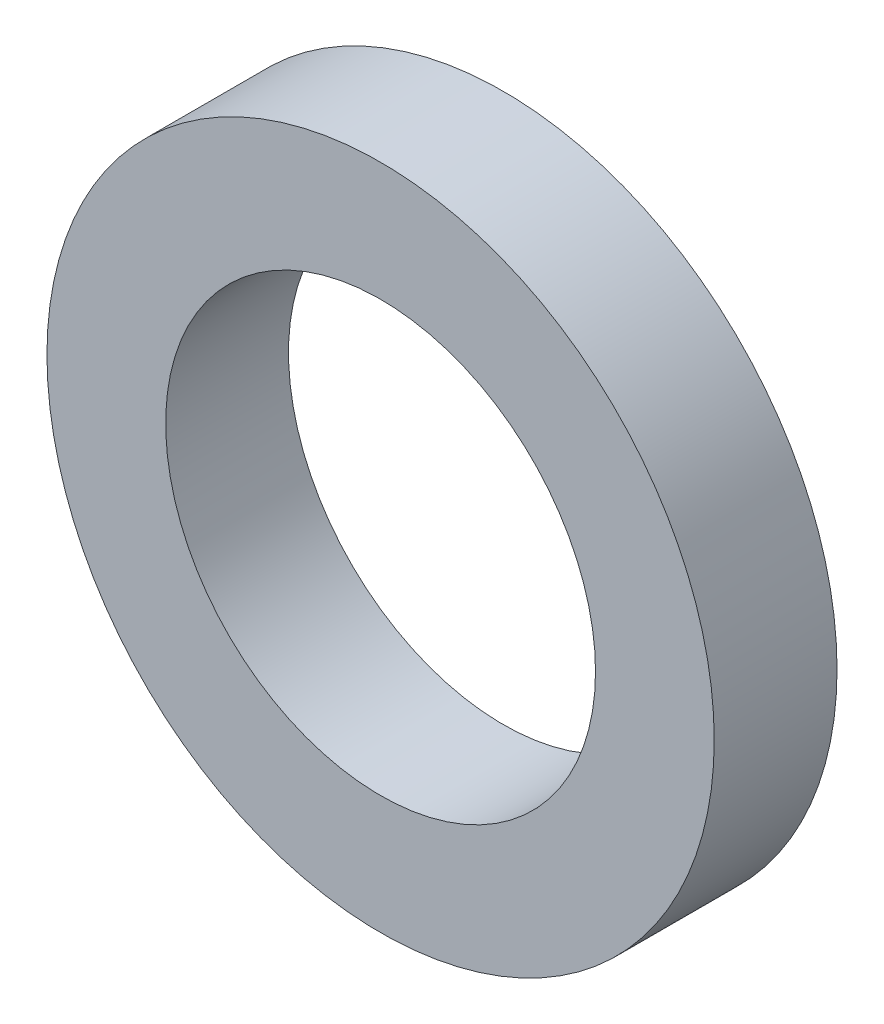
ISO-10303-21;
HEADER;
FILE_DESCRIPTION(('STEP AP214'),'2;1');
FILE_NAME('part.step','',(''),(''),'','','');
FILE_SCHEMA(('AUTOMOTIVE_DESIGN { 1 0 10303 214 1 1 1 1 }'));
ENDSEC;
DATA;
#1=APPLICATION_CONTEXT('core data for automotive mechanical design processes');
#2=APPLICATION_PROTOCOL_DEFINITION('international standard','automotive_design',2000,#1);
#3=PRODUCT_CONTEXT('',#1,'mechanical');
#4=PRODUCT('Part','Part','',(#3));
#5=PRODUCT_RELATED_PRODUCT_CATEGORY('part','',(#4));
#6=PRODUCT_DEFINITION_FORMATION('','',#4);
#7=PRODUCT_DEFINITION_CONTEXT('part definition',#1,'design');
#8=PRODUCT_DEFINITION('design','',#6,#7);
#9=PRODUCT_DEFINITION_SHAPE('','',#8);
#10=(LENGTH_UNIT() NAMED_UNIT(*) SI_UNIT(.MILLI.,.METRE.));
#11=(NAMED_UNIT(*) PLANE_ANGLE_UNIT() SI_UNIT($,.RADIAN.));
#12=(NAMED_UNIT(*) SI_UNIT($,.STERADIAN.) SOLID_ANGLE_UNIT());
#13=UNCERTAINTY_MEASURE_WITH_UNIT(LENGTH_MEASURE(1.E-05),#10,'distance_accuracy_value','');
#14=(GEOMETRIC_REPRESENTATION_CONTEXT(3) GLOBAL_UNCERTAINTY_ASSIGNED_CONTEXT((#13)) GLOBAL_UNIT_ASSIGNED_CONTEXT((#10,
#11,#12)) REPRESENTATION_CONTEXT('',''));
#15=CARTESIAN_POINT('',(0.,0.,0.));
#16=DIRECTION('',(0.,0.,1.));
#17=DIRECTION('',(1.,0.,0.));
#18=AXIS2_PLACEMENT_3D('',#15,#16,#17);
#19=CARTESIAN_POINT('',(0.,0.,3.));
#20=DIRECTION('',(0.,0.,1.));
#21=DIRECTION('',(1.,0.,0.));
#22=AXIS2_PLACEMENT_3D('',#19,#20,#21);
#23=PLANE('',#22);
#24=CARTESIAN_POINT('',(0.,0.,3.));
#25=DIRECTION('',(0.,0.,1.));
#26=DIRECTION('',(1.,0.,0.));
#27=AXIS2_PLACEMENT_3D('',#24,#25,#26);
#28=CIRCLE('',#27,8.15);
#29=CARTESIAN_POINT('',(8.15,0.,3.));
#30=VERTEX_POINT('',#29);
#31=EDGE_CURVE('E8',#30,#30,#28,.T.);
#32=ORIENTED_EDGE('',*,*,#31,.T.);
#33=EDGE_LOOP('',(#32));
#34=FACE_BOUND('',#33,.T.);
#35=CARTESIAN_POINT('',(0.,0.,3.));
#36=DIRECTION('',(0.,0.,1.));
#37=DIRECTION('',(1.,0.,0.));
#38=AXIS2_PLACEMENT_3D('',#35,#36,#37);
#39=CIRCLE('',#38,5.25);
#40=CARTESIAN_POINT('',(5.25,0.,3.));
#41=VERTEX_POINT('',#40);
#42=EDGE_CURVE('E23',#41,#41,#39,.T.);
#43=ORIENTED_EDGE('',*,*,#42,.F.);
#44=EDGE_LOOP('',(#43));
#45=FACE_BOUND('',#44,.T.);
#46=ADVANCED_FACE('F12',(#34,#45),#23,.T.);
#47=CARTESIAN_POINT('',(0.,0.,0.));
#48=DIRECTION('',(0.,0.,1.));
#49=DIRECTION('',(1.,0.,0.));
#50=AXIS2_PLACEMENT_3D('',#47,#48,#49);
#51=PLANE('',#50);
#52=CARTESIAN_POINT('',(0.,0.,0.));
#53=DIRECTION('',(0.,0.,1.));
#54=DIRECTION('',(1.,0.,0.));
#55=AXIS2_PLACEMENT_3D('',#52,#53,#54);
#56=CIRCLE('',#55,8.15);
#57=CARTESIAN_POINT('',(8.15,0.,0.));
#58=VERTEX_POINT('',#57);
#59=EDGE_CURVE('E19',#58,#58,#56,.T.);
#60=ORIENTED_EDGE('',*,*,#59,.F.);
#61=EDGE_LOOP('',(#60));
#62=FACE_BOUND('',#61,.T.);
#63=CARTESIAN_POINT('',(0.,0.,0.));
#64=DIRECTION('',(0.,0.,1.));
#65=DIRECTION('',(1.,0.,0.));
#66=AXIS2_PLACEMENT_3D('',#63,#64,#65);
#67=CIRCLE('',#66,5.25);
#68=CARTESIAN_POINT('',(5.25,0.,0.));
#69=VERTEX_POINT('',#68);
#70=EDGE_CURVE('E27',#69,#69,#67,.T.);
#71=ORIENTED_EDGE('',*,*,#70,.T.);
#72=EDGE_LOOP('',(#71));
#73=FACE_BOUND('',#72,.T.);
#74=ADVANCED_FACE('F33',(#62,#73),#51,.F.);
#75=CARTESIAN_POINT('',(0.,0.,3.));
#76=DIRECTION('',(0.,0.,-1.));
#77=DIRECTION('',(-1.,0.,0.));
#78=AXIS2_PLACEMENT_3D('',#75,#76,#77);
#79=CYLINDRICAL_SURFACE('',#78,8.15);
#80=ORIENTED_EDGE('',*,*,#31,.F.);
#81=EDGE_LOOP('',(#80));
#82=FACE_BOUND('',#81,.T.);
#83=ORIENTED_EDGE('',*,*,#59,.T.);
#84=EDGE_LOOP('',(#83));
#85=FACE_BOUND('',#84,.T.);
#86=ADVANCED_FACE('F14',(#82,#85),#79,.T.);
#87=CARTESIAN_POINT('',(0.,0.,3.));
#88=DIRECTION('',(0.,0.,-1.));
#89=DIRECTION('',(-1.,0.,0.));
#90=AXIS2_PLACEMENT_3D('',#87,#88,#89);
#91=CYLINDRICAL_SURFACE('',#90,5.25);
#92=ORIENTED_EDGE('',*,*,#42,.T.);
#93=EDGE_LOOP('',(#92));
#94=FACE_BOUND('',#93,.T.);
#95=ORIENTED_EDGE('',*,*,#70,.F.);
#96=EDGE_LOOP('',(#95));
#97=FACE_BOUND('',#96,.T.);
#98=ADVANCED_FACE('F35',(#94,#97),#91,.F.);
#99=CLOSED_SHELL('',(#46,#74,#86,#98));
#100=MANIFOLD_SOLID_BREP('B1',#99);
#101=ADVANCED_BREP_SHAPE_REPRESENTATION('',(#18,#100),#14);
#102=SHAPE_DEFINITION_REPRESENTATION(#9,#101);
ENDSEC;
END-ISO-10303-21;
